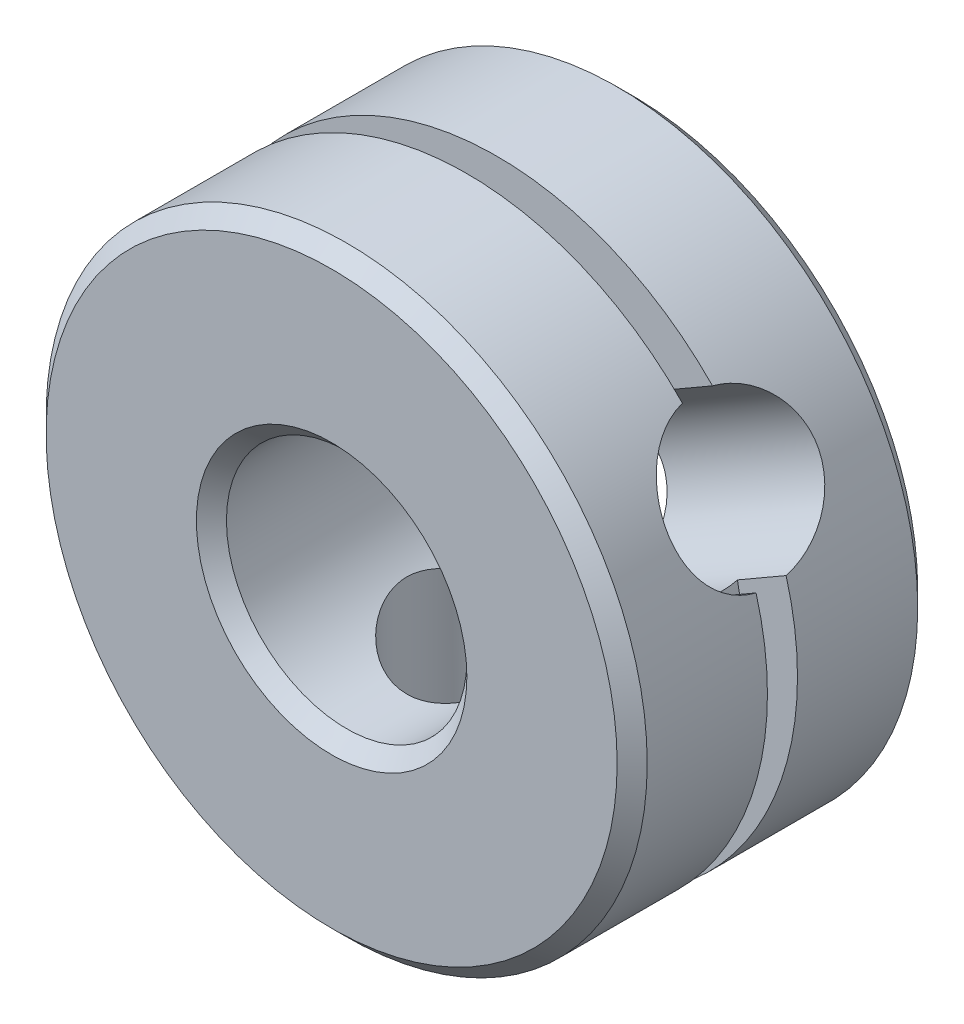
ISO-10303-21;
HEADER;
FILE_DESCRIPTION(('STEP AP214'),'2;1');
FILE_NAME('part.step','',(''),(''),'','','');
FILE_SCHEMA(('AUTOMOTIVE_DESIGN { 1 0 10303 214 1 1 1 1 }'));
ENDSEC;
DATA;
#1=APPLICATION_CONTEXT('core data for automotive mechanical design processes');
#2=APPLICATION_PROTOCOL_DEFINITION('international standard','automotive_design',2000,#1);
#3=PRODUCT_CONTEXT('',#1,'mechanical');
#4=PRODUCT('Part','Part','',(#3));
#5=PRODUCT_RELATED_PRODUCT_CATEGORY('part','',(#4));
#6=PRODUCT_DEFINITION_FORMATION('','',#4);
#7=PRODUCT_DEFINITION_CONTEXT('part definition',#1,'design');
#8=PRODUCT_DEFINITION('design','',#6,#7);
#9=PRODUCT_DEFINITION_SHAPE('','',#8);
#10=(LENGTH_UNIT() NAMED_UNIT(*) SI_UNIT(.MILLI.,.METRE.));
#11=(NAMED_UNIT(*) PLANE_ANGLE_UNIT() SI_UNIT($,.RADIAN.));
#12=(NAMED_UNIT(*) SI_UNIT($,.STERADIAN.) SOLID_ANGLE_UNIT());
#13=UNCERTAINTY_MEASURE_WITH_UNIT(LENGTH_MEASURE(1.E-05),#10,'distance_accuracy_value','');
#14=(GEOMETRIC_REPRESENTATION_CONTEXT(3) GLOBAL_UNCERTAINTY_ASSIGNED_CONTEXT((#13)) GLOBAL_UNIT_ASSIGNED_CONTEXT((#10,
#11,#12)) REPRESENTATION_CONTEXT('',''));
#15=CARTESIAN_POINT('',(0.,0.,0.));
#16=DIRECTION('',(0.,0.,1.));
#17=DIRECTION('',(1.,0.,0.));
#18=AXIS2_PLACEMENT_3D('',#15,#16,#17);
#19=CARTESIAN_POINT('',(0.,0.,-10.));
#20=DIRECTION('',(0.,0.,1.));
#21=DIRECTION('',(1.,0.,0.));
#22=AXIS2_PLACEMENT_3D('',#19,#20,#21);
#23=CYLINDRICAL_SURFACE('',#22,10.);
#24=CARTESIAN_POINT('',(0.,0.,-4.5));
#25=DIRECTION('',(0.,0.,-1.));
#26=DIRECTION('',(-1.,0.,0.));
#27=AXIS2_PLACEMENT_3D('',#24,#25,#26);
#28=CIRCLE('',#27,10.);
#29=CARTESIAN_POINT('',(-2.44948974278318,-9.69535971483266,-4.5));
#30=VERTEX_POINT('',#29);
#31=CARTESIAN_POINT('',(7.17168294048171,6.96900020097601,-4.5));
#32=VERTEX_POINT('',#31);
#33=EDGE_CURVE('E227',#30,#32,#28,.T.);
#34=ORIENTED_EDGE('',*,*,#33,.F.);
#35=CARTESIAN_POINT('',(0.,-10.,-2.5));
#36=CARTESIAN_POINT('',(-0.138126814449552,-9.99999766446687,-2.50000387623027));
#37=CARTESIAN_POINT('',(-0.276296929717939,-9.99710963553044,-2.51148591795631));
#38=CARTESIAN_POINT('',(-0.548677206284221,-9.98586856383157,-2.55704191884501));
#39=CARTESIAN_POINT('',(-0.682885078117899,-9.97751242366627,-2.59112868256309));
#40=CARTESIAN_POINT('',(-0.943368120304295,-9.9562604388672,-2.68073208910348));
#41=CARTESIAN_POINT('',(-1.06965260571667,-9.94337004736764,-2.73622299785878));
#42=CARTESIAN_POINT('',(-1.31112021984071,-9.91442239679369,-2.86696898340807));
#43=CARTESIAN_POINT('',(-1.42630297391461,-9.89836503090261,-2.94222472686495));
#44=CARTESIAN_POINT('',(-1.64466987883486,-9.86445689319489,-3.1120013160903));
#45=CARTESIAN_POINT('',(-1.74759281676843,-9.84657845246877,-3.20685262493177));
#46=CARTESIAN_POINT('',(-1.93624821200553,-9.8112270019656,-3.41242034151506));
#47=CARTESIAN_POINT('',(-2.02197872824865,-9.79375403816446,-3.5231385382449));
#48=CARTESIAN_POINT('',(-2.17504423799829,-9.76091292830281,-3.75932537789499));
#49=CARTESIAN_POINT('',(-2.2420870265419,-9.74557990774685,-3.88498871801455));
#50=CARTESIAN_POINT('',(-2.35399484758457,-9.71915824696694,-4.14624735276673));
#51=CARTESIAN_POINT('',(-2.39886342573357,-9.70806892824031,-4.28184105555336));
#52=CARTESIAN_POINT('',(-2.46425806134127,-9.69167461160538,-4.55623916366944));
#53=CARTESIAN_POINT('',(-2.48525378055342,-9.68625818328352,-4.69492482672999));
#54=CARTESIAN_POINT('',(-2.50376962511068,-9.68148937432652,-4.97394761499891));
#55=CARTESIAN_POINT('',(-2.50129356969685,-9.68213600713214,-5.11428446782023));
#56=CARTESIAN_POINT('',(-2.47331087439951,-9.68932009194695,-5.38902634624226));
#57=CARTESIAN_POINT('',(-2.44836390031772,-9.69571438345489,-5.52349270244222));
#58=CARTESIAN_POINT('',(-2.37704031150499,-9.71344516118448,-5.7862684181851));
#59=CARTESIAN_POINT('',(-2.33066217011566,-9.72478199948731,-5.91457733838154));
#60=CARTESIAN_POINT('',(-2.21731579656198,-9.75125189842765,-6.16289669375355));
#61=CARTESIAN_POINT('',(-2.1501444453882,-9.76642212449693,-6.28281028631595));
#62=CARTESIAN_POINT('',(-1.99726046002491,-9.79882851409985,-6.50986451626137));
#63=CARTESIAN_POINT('',(-1.91154458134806,-9.81606503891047,-6.61700291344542));
#64=CARTESIAN_POINT('',(-1.72110570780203,-9.85126467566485,-6.81867269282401));
#65=CARTESIAN_POINT('',(-1.61591043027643,-9.86923449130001,-6.91275748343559));
#66=CARTESIAN_POINT('',(-1.39101986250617,-9.90343275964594,-7.08203540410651));
#67=CARTESIAN_POINT('',(-1.27132412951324,-9.91966115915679,-7.15722795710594));
#68=CARTESIAN_POINT('',(-1.02019314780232,-9.94862886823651,-7.28675097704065));
#69=CARTESIAN_POINT('',(-0.888718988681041,-9.96135600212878,-7.34100890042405));
#70=CARTESIAN_POINT('',(-0.61812668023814,-9.98179861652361,-7.42652884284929));
#71=CARTESIAN_POINT('',(-0.479009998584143,-9.98951505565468,-7.4577952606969));
#72=CARTESIAN_POINT('',(-0.200899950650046,-9.99892498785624,-7.49576260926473));
#73=CARTESIAN_POINT('',(-0.0619945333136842,-10.0007675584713,-7.50307171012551));
#74=CARTESIAN_POINT('',(0.215054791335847,-9.99864674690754,-7.49458499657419));
#75=CARTESIAN_POINT('',(0.353198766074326,-9.99468388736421,-7.47879126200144));
#76=CARTESIAN_POINT('',(0.622690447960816,-9.98149301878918,-7.42504848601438));
#77=CARTESIAN_POINT('',(0.754108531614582,-9.97234390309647,-7.38743122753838));
#78=CARTESIAN_POINT('',(1.00876215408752,-9.94981177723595,-7.2914881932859));
#79=CARTESIAN_POINT('',(1.13199686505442,-9.93642833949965,-7.23316032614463));
#80=CARTESIAN_POINT('',(1.36920522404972,-9.9065551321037,-7.09627311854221));
#81=CARTESIAN_POINT('',(1.48297573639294,-9.89001445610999,-7.01737314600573));
#82=CARTESIAN_POINT('',(1.69587768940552,-9.85574181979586,-6.84201681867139));
#83=CARTESIAN_POINT('',(1.79500659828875,-9.83800965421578,-6.74555743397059));
#84=CARTESIAN_POINT('',(1.97831761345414,-9.80281594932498,-6.53499673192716));
#85=CARTESIAN_POINT('',(2.06207311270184,-9.78537173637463,-6.42052049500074));
#86=CARTESIAN_POINT('',(2.20918459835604,-9.75321463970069,-6.17877894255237));
#87=CARTESIAN_POINT('',(2.27254149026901,-9.73850163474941,-6.05151419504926));
#88=CARTESIAN_POINT('',(2.37658570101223,-9.71363491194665,-5.78849046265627));
#89=CARTESIAN_POINT('',(2.41740732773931,-9.70345425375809,-5.65278728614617));
#90=CARTESIAN_POINT('',(2.47557609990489,-9.68877906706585,-5.37615060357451));
#91=CARTESIAN_POINT('',(2.49292837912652,-9.68428329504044,-5.23521824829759));
#92=CARTESIAN_POINT('',(2.50339765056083,-9.68158168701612,-4.95646496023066));
#93=CARTESIAN_POINT('',(2.49719649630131,-9.68319887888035,-4.81867094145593));
#94=CARTESIAN_POINT('',(2.46229546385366,-9.69213181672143,-4.54616018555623));
#95=CARTESIAN_POINT('',(2.43359603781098,-9.69944744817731,-4.41144338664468));
#96=CARTESIAN_POINT('',(2.35488553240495,-9.71885434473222,-4.14965256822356));
#97=CARTESIAN_POINT('',(2.30500234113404,-9.73091692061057,-4.02253782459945));
#98=CARTESIAN_POINT('',(2.18544152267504,-9.7584625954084,-3.77839102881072));
#99=CARTESIAN_POINT('',(2.11576115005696,-9.77394616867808,-3.66136037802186));
#100=CARTESIAN_POINT('',(1.95644624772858,-9.80709390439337,-3.43740895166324));
#101=CARTESIAN_POINT('',(1.86633860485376,-9.82480441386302,-3.33083154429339));
#102=CARTESIAN_POINT('',(1.66964895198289,-9.86013378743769,-3.13408825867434));
#103=CARTESIAN_POINT('',(1.56306303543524,-9.87775262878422,-3.04392628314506));
#104=CARTESIAN_POINT('',(1.33411264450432,-9.91129426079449,-2.88098115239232));
#105=CARTESIAN_POINT('',(1.21149737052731,-9.92718055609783,-2.80854231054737));
#106=CARTESIAN_POINT('',(0.955443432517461,-9.95508208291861,-2.68542089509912));
#107=CARTESIAN_POINT('',(0.8220126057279,-9.96710008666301,-2.63472273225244));
#108=CARTESIAN_POINT('',(0.574017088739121,-9.98413432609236,-2.56404694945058));
#109=CARTESIAN_POINT('',(0.460633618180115,-9.99004308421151,-2.54008126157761));
#110=CARTESIAN_POINT('',(0.231510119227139,-9.9979767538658,-2.5080567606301));
#111=CARTESIAN_POINT('',(0.115770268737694,-10.0000019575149,-2.49999675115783));
#112=CARTESIAN_POINT('',(0.,-10.,-2.5));
#113=B_SPLINE_CURVE_WITH_KNOTS('',3,(#35,#36,#37,#38,#39,#40,#41,#42,#43,#44,#45,#46,#47,#48,
#49,#50,#51,#52,#53,#54,#55,#56,#57,#58,#59,#60,#61,#62,#63,#64,#65,#66,#67,#68,#69,#70,#71,#72,
#73,#74,#75,#76,#77,#78,#79,#80,#81,#82,#83,#84,#85,#86,#87,#88,#89,#90,#91,#92,#93,#94,#95,#96,
#97,#98,#99,#100,#101,#102,#103,#104,#105,#106,#107,#108,#109,#110,#111,#112),.UNSPECIFIED.,.T.,
.F.,(4,2,2,2,2,2,2,2,2,2,2,2,2,2,2,2,2,2,2,2,2,2,2,2,2,2,2,2,2,2,2,2,2,2,2,2,2,2,4),(0.,
0.41395618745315,0.828147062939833,1.24184150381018,1.65554990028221,2.07690725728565,
2.4983121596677,2.92597745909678,3.35357435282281,3.77260491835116,4.19156730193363,
4.60037495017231,5.00921172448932,5.42217546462,5.83521151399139,6.26002501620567,
6.6848514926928,7.11113715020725,7.53734122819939,7.95263848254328,8.36789835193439,
8.7770045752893,9.18615212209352,9.60255979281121,10.0190393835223,10.4457418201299,
10.8724253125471,11.2965375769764,11.7205570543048,12.1323963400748,12.5442273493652,
12.9536066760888,13.3630428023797,13.7831596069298,14.2033761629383,14.6312030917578,
15.0587227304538,15.4057040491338,15.752659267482),.UNSPECIFIED.);
#114=CARTESIAN_POINT('',(2.44948974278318,-9.69535971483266,-4.5));
#115=VERTEX_POINT('',#114);
#116=EDGE_CURVE('E124',#115,#30,#113,.T.);
#117=ORIENTED_EDGE('',*,*,#116,.F.);
#118=CARTESIAN_POINT('',(9.62117268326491,2.72635951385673,-4.5));
#119=VERTEX_POINT('',#118);
#120=EDGE_CURVE('E392',#119,#115,#28,.T.);
#121=ORIENTED_EDGE('',*,*,#120,.F.);
#122=CARTESIAN_POINT('',(9.6352549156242,2.67616567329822,-5.));
#123=CARTESIAN_POINT('',(9.63525523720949,2.67617038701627,-5.13805075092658));
#124=CARTESIAN_POINT('',(9.63210285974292,2.68759458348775,-5.27614489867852));
#125=CARTESIAN_POINT('',(9.61937602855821,2.73278922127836,-5.54836757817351));
#126=CARTESIAN_POINT('',(9.60979783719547,2.76657266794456,-5.68249375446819));
#127=CARTESIAN_POINT('',(9.58391006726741,2.85495532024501,-5.94280353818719));
#128=CARTESIAN_POINT('',(9.56760917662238,2.90952765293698,-6.06899715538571));
#129=CARTESIAN_POINT('',(9.5278131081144,3.03730745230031,-6.31031085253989));
#130=CARTESIAN_POINT('',(9.5043176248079,3.11051571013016,-6.42543046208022));
#131=CARTESIAN_POINT('',(9.44907629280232,3.27453410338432,-6.64386164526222));
#132=CARTESIAN_POINT('',(9.4171759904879,3.36566467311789,-6.74689360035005));
#133=CARTESIAN_POINT('',(9.34490436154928,3.56140836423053,-6.93576139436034));
#134=CARTESIAN_POINT('',(9.30453224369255,3.66602274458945,-7.02159562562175));
#135=CARTESIAN_POINT('',(9.21449269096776,3.88683880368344,-7.17477546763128));
#136=CARTESIAN_POINT('',(9.16470341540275,4.00318179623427,-7.24184638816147));
#137=CARTESIAN_POINT('',(9.05647555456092,4.24234044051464,-7.35380964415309));
#138=CARTESIAN_POINT('',(8.9980382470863,4.36515513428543,-7.39870525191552));
#139=CARTESIAN_POINT('',(8.87468040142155,4.61069782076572,-7.46414783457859));
#140=CARTESIAN_POINT('',(8.80991518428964,4.73337716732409,-7.48516964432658));
#141=CARTESIAN_POINT('',(8.67447899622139,4.97723353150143,-7.50375837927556));
#142=CARTESIAN_POINT('',(8.60380889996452,5.09841076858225,-7.5013287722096));
#143=CARTESIAN_POINT('',(8.46033146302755,5.33303795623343,-7.47342514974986));
#144=CARTESIAN_POINT('',(8.38760634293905,5.44659970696,-7.44846367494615));
#145=CARTESIAN_POINT('',(8.24102110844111,5.66594946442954,-7.3770287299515));
#146=CARTESIAN_POINT('',(8.16716093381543,5.77173705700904,-7.33055411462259));
#147=CARTESIAN_POINT('',(8.02036378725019,5.9740726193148,-7.21699742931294));
#148=CARTESIAN_POINT('',(7.94744118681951,6.07052846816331,-7.14973295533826));
#149=CARTESIAN_POINT('',(7.80609517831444,6.25124461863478,-6.99664432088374));
#150=CARTESIAN_POINT('',(7.73767255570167,6.33550279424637,-6.91081693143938));
#151=CARTESIAN_POINT('',(7.60646202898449,6.49249557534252,-6.72029125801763));
#152=CARTESIAN_POINT('',(7.54387674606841,6.56485658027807,-6.61514510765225));
#153=CARTESIAN_POINT('',(7.42950428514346,6.69402197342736,-6.39040002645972));
#154=CARTESIAN_POINT('',(7.37771761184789,6.75082563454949,-6.27080042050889));
#155=CARTESIAN_POINT('',(7.28744965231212,6.84817688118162,-6.01970996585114));
#156=CARTESIAN_POINT('',(7.24903410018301,6.88864430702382,-5.8881642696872));
#157=CARTESIAN_POINT('',(7.1881168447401,6.95218921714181,-5.61741453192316));
#158=CARTESIAN_POINT('',(7.16561173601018,6.97527042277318,-5.4782121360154));
#159=CARTESIAN_POINT('',(7.13828856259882,7.00322865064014,-5.20004049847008));
#160=CARTESIAN_POINT('',(7.1330190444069,7.00857038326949,-5.06116220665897));
#161=CARTESIAN_POINT('',(7.13922190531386,7.00225180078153,-4.78417806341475));
#162=CARTESIAN_POINT('',(7.15069274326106,6.99059305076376,-4.64607214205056));
#163=CARTESIAN_POINT('',(7.18934405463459,6.95083246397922,-4.37688573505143));
#164=CARTESIAN_POINT('',(7.21626442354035,6.92300278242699,-4.2457272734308));
#165=CARTESIAN_POINT('',(7.28408845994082,6.85160306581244,-3.99156854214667));
#166=CARTESIAN_POINT('',(7.32499378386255,6.80803116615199,-3.86856924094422));
#167=CARTESIAN_POINT('',(7.41957761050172,6.70483734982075,-3.6315587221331));
#168=CARTESIAN_POINT('',(7.47349094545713,6.64491734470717,-3.51777115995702));
#169=CARTESIAN_POINT('',(7.59098627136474,6.51036775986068,-3.30481163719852));
#170=CARTESIAN_POINT('',(7.65456985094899,6.43573576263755,-3.20564208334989));
#171=CARTESIAN_POINT('',(7.79021214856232,6.27090481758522,-3.02218895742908));
#172=CARTESIAN_POINT('',(7.86244311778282,6.1803630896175,-2.9383399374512));
#173=CARTESIAN_POINT('',(8.01084582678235,5.98675234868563,-2.79106413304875));
#174=CARTESIAN_POINT('',(8.0870173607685,5.88368398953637,-2.72763628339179));
#175=CARTESIAN_POINT('',(8.23956671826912,5.66805412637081,-2.62355396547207));
#176=CARTESIAN_POINT('',(8.31593892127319,5.55556787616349,-2.58273571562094));
#177=CARTESIAN_POINT('',(8.46649332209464,5.32330927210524,-2.52453966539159));
#178=CARTESIAN_POINT('',(8.54067593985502,5.20353832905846,-2.50715734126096));
#179=CARTESIAN_POINT('',(8.68234823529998,4.96344019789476,-2.49658102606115));
#180=CARTESIAN_POINT('',(8.74996464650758,4.84321561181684,-2.50274572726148));
#181=CARTESIAN_POINT('',(8.87886382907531,4.60265155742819,-2.53761956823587));
#182=CARTESIAN_POINT('',(8.94014678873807,4.48231209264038,-2.56632803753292));
#183=CARTESIAN_POINT('',(9.05484155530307,4.24582601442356,-2.64513054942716));
#184=CARTESIAN_POINT('',(9.10829395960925,4.12966031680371,-2.69510863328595));
#185=CARTESIAN_POINT('',(9.20712587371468,3.90435464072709,-2.81492644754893));
#186=CARTESIAN_POINT('',(9.25250436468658,3.79521555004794,-2.88476868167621));
#187=CARTESIAN_POINT('',(9.33607529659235,3.58480572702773,-3.04428808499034));
#188=CARTESIAN_POINT('',(9.37406953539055,3.48378613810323,-3.13440035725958));
#189=CARTESIAN_POINT('',(9.4417659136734,3.29591417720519,-3.33105712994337));
#190=CARTESIAN_POINT('',(9.47146594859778,3.20906540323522,-3.43760579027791));
#191=CARTESIAN_POINT('',(9.52353066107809,3.05113481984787,-3.66650353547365));
#192=CARTESIAN_POINT('',(9.54574815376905,2.98037738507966,-3.78911030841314));
#193=CARTESIAN_POINT('',(9.58262240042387,2.85960890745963,-4.04513872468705));
#194=CARTESIAN_POINT('',(9.59728465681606,2.80958277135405,-4.17855241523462));
#195=CARTESIAN_POINT('',(9.61743337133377,2.73971219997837,-4.4264425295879));
#196=CARTESIAN_POINT('',(9.62413024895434,2.71595058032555,-4.53973291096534));
#197=CARTESIAN_POINT('',(9.63304069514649,2.68417601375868,-4.76867217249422));
#198=CARTESIAN_POINT('',(9.63525464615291,2.67616172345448,-4.88432085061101));
#199=CARTESIAN_POINT('',(9.6352549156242,2.67616567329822,-5.));
#200=B_SPLINE_CURVE_WITH_KNOTS('',3,(#122,#123,#124,#125,#126,#127,#128,#129,#130,#131,#132,
#133,#134,#135,#136,#137,#138,#139,#140,#141,#142,#143,#144,#145,#146,#147,#148,#149,#150,#151,
#152,#153,#154,#155,#156,#157,#158,#159,#160,#161,#162,#163,#164,#165,#166,#167,#168,#169,#170,
#171,#172,#173,#174,#175,#176,#177,#178,#179,#180,#181,#182,#183,#184,#185,#186,#187,#188,#189,
#190,#191,#192,#193,#194,#195,#196,#197,#198,#199),.UNSPECIFIED.,.T.,.F.,(4,2,2,2,2,2,2,2,2,2,2,
2,2,2,2,2,2,2,2,2,2,2,2,2,2,2,2,2,2,2,2,2,2,2,2,2,2,2,4),(0.,0.413727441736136,
0.827695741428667,1.24113072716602,1.65458326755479,2.07623954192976,2.49793521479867,
2.9255149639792,3.35303159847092,3.77188750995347,4.19068148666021,4.60018262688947,
5.00970556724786,5.42292874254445,5.83622385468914,6.26070466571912,6.68520531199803,
7.11176432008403,7.53823200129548,7.95343574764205,8.36860127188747,8.77697405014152,
9.18539521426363,9.60182845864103,10.0183301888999,10.4452533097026,10.872154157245,
11.2959207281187,11.7196054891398,12.131834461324,12.5440511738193,12.9540487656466,
13.3640980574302,13.7839709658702,14.2039503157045,14.6317647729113,15.0592672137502,
15.4059782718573,15.7526597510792),.UNSPECIFIED.);
#201=EDGE_CURVE('E121',#32,#119,#200,.T.);
#202=ORIENTED_EDGE('',*,*,#201,.F.);
#203=EDGE_LOOP('',(#34,#117,#121,#202));
#204=FACE_BOUND('',#203,.T.);
#205=CARTESIAN_POINT('',(0.,0.,-0.500000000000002));
#206=DIRECTION('',(0.,0.,1.));
#207=DIRECTION('',(1.,0.,0.));
#208=AXIS2_PLACEMENT_3D('',#205,#206,#207);
#209=CIRCLE('',#208,10.);
#210=CARTESIAN_POINT('',(10.,0.,-0.500000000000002));
#211=VERTEX_POINT('',#210);
#212=EDGE_CURVE('E230',#211,#211,#209,.F.);
#213=ORIENTED_EDGE('',*,*,#212,.T.);
#214=EDGE_LOOP('',(#213));
#215=FACE_BOUND('',#214,.T.);
#216=ADVANCED_FACE('F32',(#204,#215),#23,.T.);
#217=CARTESIAN_POINT('',(0.,0.,-5.5));
#218=DIRECTION('',(0.,0.,-1.));
#219=DIRECTION('',(-1.,0.,0.));
#220=AXIS2_PLACEMENT_3D('',#217,#218,#219);
#221=CIRCLE('',#220,10.);
#222=CARTESIAN_POINT('',(9.62117268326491,2.72635951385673,-5.5));
#223=VERTEX_POINT('',#222);
#224=CARTESIAN_POINT('',(2.44948974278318,-9.69535971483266,-5.5));
#225=VERTEX_POINT('',#224);
#226=EDGE_CURVE('E55',#223,#225,#221,.T.);
#227=ORIENTED_EDGE('',*,*,#226,.T.);
#228=CARTESIAN_POINT('',(-2.44948974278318,-9.69535971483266,-5.5));
#229=VERTEX_POINT('',#228);
#230=EDGE_CURVE('E113',#229,#225,#113,.T.);
#231=ORIENTED_EDGE('',*,*,#230,.F.);
#232=CARTESIAN_POINT('',(7.17168294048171,6.96900020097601,-5.5));
#233=VERTEX_POINT('',#232);
#234=EDGE_CURVE('E98',#229,#233,#221,.T.);
#235=ORIENTED_EDGE('',*,*,#234,.T.);
#236=EDGE_CURVE('E111',#223,#233,#200,.T.);
#237=ORIENTED_EDGE('',*,*,#236,.F.);
#238=EDGE_LOOP('',(#227,#231,#235,#237));
#239=FACE_BOUND('',#238,.T.);
#240=CARTESIAN_POINT('',(0.,0.,-9.5));
#241=DIRECTION('',(0.,0.,1.));
#242=DIRECTION('',(1.,0.,0.));
#243=AXIS2_PLACEMENT_3D('',#240,#241,#242);
#244=CIRCLE('',#243,10.);
#245=CARTESIAN_POINT('',(10.,0.,-9.5));
#246=VERTEX_POINT('',#245);
#247=EDGE_CURVE('E231',#246,#246,#244,.T.);
#248=ORIENTED_EDGE('',*,*,#247,.T.);
#249=EDGE_LOOP('',(#248));
#250=FACE_BOUND('',#249,.T.);
#251=ADVANCED_FACE('F109',(#239,#250),#23,.T.);
#252=CARTESIAN_POINT('',(0.,0.,-10.));
#253=DIRECTION('',(0.,0.,1.));
#254=DIRECTION('',(1.,0.,0.));
#255=AXIS2_PLACEMENT_3D('',#252,#253,#254);
#256=PLANE('',#255);
#257=CARTESIAN_POINT('',(0.,0.,-10.));
#258=DIRECTION('',(0.,0.,1.));
#259=DIRECTION('',(1.,0.,0.));
#260=AXIS2_PLACEMENT_3D('',#257,#258,#259);
#261=CIRCLE('',#260,4.5);
#262=CARTESIAN_POINT('',(4.5,0.,-10.));
#263=VERTEX_POINT('',#262);
#264=EDGE_CURVE('E240',#263,#263,#261,.T.);
#265=ORIENTED_EDGE('',*,*,#264,.T.);
#266=EDGE_LOOP('',(#265));
#267=FACE_BOUND('',#266,.T.);
#268=CARTESIAN_POINT('',(0.,0.,-10.));
#269=DIRECTION('',(0.,0.,1.));
#270=DIRECTION('',(1.,0.,0.));
#271=AXIS2_PLACEMENT_3D('',#268,#269,#270);
#272=CIRCLE('',#271,9.5);
#273=CARTESIAN_POINT('',(9.5,0.,-10.));
#274=VERTEX_POINT('',#273);
#275=EDGE_CURVE('E233',#274,#274,#272,.F.);
#276=ORIENTED_EDGE('',*,*,#275,.T.);
#277=EDGE_LOOP('',(#276));
#278=FACE_BOUND('',#277,.T.);
#279=ADVANCED_FACE('F223',(#267,#278),#256,.F.);
#280=CARTESIAN_POINT('',(0.,0.,0.));
#281=DIRECTION('',(0.,0.,1.));
#282=DIRECTION('',(1.,0.,0.));
#283=AXIS2_PLACEMENT_3D('',#280,#281,#282);
#284=PLANE('',#283);
#285=CARTESIAN_POINT('',(0.,0.,0.));
#286=DIRECTION('',(0.,0.,1.));
#287=DIRECTION('',(1.,0.,0.));
#288=AXIS2_PLACEMENT_3D('',#285,#286,#287);
#289=CIRCLE('',#288,4.5);
#290=CARTESIAN_POINT('',(4.5,0.,0.));
#291=VERTEX_POINT('',#290);
#292=EDGE_CURVE('E104',#291,#291,#289,.F.);
#293=ORIENTED_EDGE('',*,*,#292,.T.);
#294=EDGE_LOOP('',(#293));
#295=FACE_BOUND('',#294,.T.);
#296=CARTESIAN_POINT('',(0.,0.,0.));
#297=DIRECTION('',(0.,0.,1.));
#298=DIRECTION('',(1.,0.,0.));
#299=AXIS2_PLACEMENT_3D('',#296,#297,#298);
#300=CIRCLE('',#299,9.5);
#301=CARTESIAN_POINT('',(9.5,0.,0.));
#302=VERTEX_POINT('',#301);
#303=EDGE_CURVE('E238',#302,#302,#300,.T.);
#304=ORIENTED_EDGE('',*,*,#303,.T.);
#305=EDGE_LOOP('',(#304));
#306=FACE_BOUND('',#305,.T.);
#307=ADVANCED_FACE('F207',(#295,#306),#284,.T.);
#308=CARTESIAN_POINT('',(0.,0.,-10.));
#309=DIRECTION('',(0.,0.,1.));
#310=DIRECTION('',(1.,0.,0.));
#311=AXIS2_PLACEMENT_3D('',#308,#309,#310);
#312=CYLINDRICAL_SURFACE('',#311,4.);
#313=CARTESIAN_POINT('',(0.,0.,-9.49999999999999));
#314=DIRECTION('',(0.,0.,1.));
#315=DIRECTION('',(1.,0.,0.));
#316=AXIS2_PLACEMENT_3D('',#313,#314,#315);
#317=CIRCLE('',#316,4.);
#318=CARTESIAN_POINT('',(4.,0.,-9.49999999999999));
#319=VERTEX_POINT('',#318);
#320=EDGE_CURVE('E258',#319,#319,#317,.F.);
#321=ORIENTED_EDGE('',*,*,#320,.T.);
#322=EDGE_LOOP('',(#321));
#323=FACE_BOUND('',#322,.T.);
#324=CARTESIAN_POINT('',(0.,0.,-0.5));
#325=DIRECTION('',(0.,0.,1.));
#326=DIRECTION('',(1.,0.,0.));
#327=AXIS2_PLACEMENT_3D('',#324,#325,#326);
#328=CIRCLE('',#327,4.);
#329=CARTESIAN_POINT('',(4.,0.,-0.5));
#330=VERTEX_POINT('',#329);
#331=EDGE_CURVE('E260',#330,#330,#328,.T.);
#332=ORIENTED_EDGE('',*,*,#331,.T.);
#333=EDGE_LOOP('',(#332));
#334=FACE_BOUND('',#333,.T.);
#335=CARTESIAN_POINT('',(4.,0.,-6.49999999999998));
#336=CARTESIAN_POINT('',(3.9999969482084,0.0987788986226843,-6.61406170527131));
#337=CARTESIAN_POINT('',(3.99632017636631,0.206437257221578,-6.72052845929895));
#338=CARTESIAN_POINT('',(3.97786278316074,0.435751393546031,-6.91659296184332));
#339=CARTESIAN_POINT('',(3.96305623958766,0.557439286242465,-7.00615071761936));
#340=CARTESIAN_POINT('',(3.91895755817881,0.811450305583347,-7.16603627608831));
#341=CARTESIAN_POINT('',(3.88959514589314,0.943822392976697,-7.23626819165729));
#342=CARTESIAN_POINT('',(3.81395521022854,1.21379485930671,-7.35359275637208));
#343=CARTESIAN_POINT('',(3.76770815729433,1.35138542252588,-7.40072673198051));
#344=CARTESIAN_POINT('',(3.66352948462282,1.61120760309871,-7.46526784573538));
#345=CARTESIAN_POINT('',(3.60739408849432,1.7334965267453,-7.4853310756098));
#346=CARTESIAN_POINT('',(3.4821851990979,1.97296614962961,-7.50344059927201));
#347=CARTESIAN_POINT('',(3.41311860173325,2.09014953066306,-7.50149859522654));
#348=CARTESIAN_POINT('',(3.27291668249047,2.30270164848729,-7.47719736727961));
#349=CARTESIAN_POINT('',(3.20285057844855,2.39905069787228,-7.45711471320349));
#350=CARTESIAN_POINT('',(3.05709279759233,2.5822251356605,-7.4006920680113));
#351=CARTESIAN_POINT('',(2.98140044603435,2.6690493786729,-7.36435012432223));
#352=CARTESIAN_POINT('',(2.82438197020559,2.83484989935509,-7.27536092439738));
#353=CARTESIAN_POINT('',(2.74295123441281,2.91343794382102,-7.22218042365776));
#354=CARTESIAN_POINT('',(2.57992924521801,3.0587428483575,-7.10179772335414));
#355=CARTESIAN_POINT('',(2.49833794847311,3.12545586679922,-7.03459100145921));
#356=CARTESIAN_POINT('',(2.3266997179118,3.25570405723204,-6.87756512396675));
#357=CARTESIAN_POINT('',(2.23703857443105,3.3175319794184,-6.78590567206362));
#358=CARTESIAN_POINT('',(2.06516568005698,3.42717250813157,-6.58811617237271));
#359=CARTESIAN_POINT('',(1.9829664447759,3.47496185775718,-6.48196253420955));
#360=CARTESIAN_POINT('',(1.82253960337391,3.56195555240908,-6.24427953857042));
#361=CARTESIAN_POINT('',(1.7456826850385,3.59969012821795,-6.11124976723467));
#362=CARTESIAN_POINT('',(1.64753666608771,3.6451246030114,-5.90158132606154));
#363=CARTESIAN_POINT('',(1.6176913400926,3.65840332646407,-5.83005292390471));
#364=CARTESIAN_POINT('',(1.56469353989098,3.68138049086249,-5.68402200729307));
#365=CARTESIAN_POINT('',(1.54153757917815,3.6910807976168,-5.6095210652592));
#366=CARTESIAN_POINT('',(1.49465901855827,3.71037902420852,-5.42576700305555));
#367=CARTESIAN_POINT('',(1.47491733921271,3.71816419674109,-5.31525969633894));
#368=CARTESIAN_POINT('',(1.4532360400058,3.72669428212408,-5.0923238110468));
#369=CARTESIAN_POINT('',(1.45128029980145,3.72744557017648,-4.97989706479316));
#370=CARTESIAN_POINT('',(1.46534347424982,3.72193734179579,-4.75643263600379));
#371=CARTESIAN_POINT('',(1.48135272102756,3.71568159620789,-4.64539423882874));
#372=CARTESIAN_POINT('',(1.52959153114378,3.69608031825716,-4.42753310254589));
#373=CARTESIAN_POINT('',(1.56183611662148,3.68272821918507,-4.3207143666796));
#374=CARTESIAN_POINT('',(1.64133328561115,3.64800897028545,-4.10899144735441));
#375=CARTESIAN_POINT('',(1.68916217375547,3.62632714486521,-4.00435863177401));
#376=CARTESIAN_POINT('',(1.79594275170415,3.57464804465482,-3.80318038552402));
#377=CARTESIAN_POINT('',(1.85489927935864,3.54464715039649,-3.70663849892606));
#378=CARTESIAN_POINT('',(1.99432678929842,3.46846086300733,-3.50283460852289));
#379=CARTESIAN_POINT('',(2.07670790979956,3.42019154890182,-3.39764914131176));
#380=CARTESIAN_POINT('',(2.24885090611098,3.30955889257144,-3.2015907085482));
#381=CARTESIAN_POINT('',(2.3386201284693,3.24718141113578,-3.11073225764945));
#382=CARTESIAN_POINT('',(2.53145361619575,3.09966993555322,-2.93611309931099));
#383=CARTESIAN_POINT('',(2.63490308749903,3.01280040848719,-2.85419435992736));
#384=CARTESIAN_POINT('',(2.78864824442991,2.86852202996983,-2.74879495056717));
#385=CARTESIAN_POINT('',(2.83967005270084,2.81808698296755,-2.71656951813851));
#386=CARTESIAN_POINT('',(2.94053489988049,2.71266619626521,-2.65836260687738));
#387=CARTESIAN_POINT('',(2.99037873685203,2.65768365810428,-2.63237678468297));
#388=CARTESIAN_POINT('',(3.08299753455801,2.54944243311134,-2.5894561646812));
#389=CARTESIAN_POINT('',(3.12596465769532,2.49661048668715,-2.57185693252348));
#390=CARTESIAN_POINT('',(3.20980961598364,2.387851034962,-2.54226829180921));
#391=CARTESIAN_POINT('',(3.2506886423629,2.33192533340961,-2.53027565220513));
#392=CARTESIAN_POINT('',(3.32985934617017,2.21740298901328,-2.51209669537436));
#393=CARTESIAN_POINT('',(3.36815247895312,2.1588078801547,-2.50590708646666));
#394=CARTESIAN_POINT('',(3.44172777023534,2.03946926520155,-2.49942606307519));
#395=CARTESIAN_POINT('',(3.47701025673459,1.97872599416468,-2.49913400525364));
#396=CARTESIAN_POINT('',(3.56891485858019,1.81040797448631,-2.50643854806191));
#397=CARTESIAN_POINT('',(3.62219098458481,1.70118559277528,-2.51998294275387));
#398=CARTESIAN_POINT('',(3.71749803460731,1.48141791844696,-2.56419748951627));
#399=CARTESIAN_POINT('',(3.75952803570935,1.37087251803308,-2.59486904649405));
#400=CARTESIAN_POINT('',(3.83262262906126,1.15088260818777,-2.67217159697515));
#401=CARTESIAN_POINT('',(3.86361080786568,1.04145067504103,-2.71890956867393));
#402=CARTESIAN_POINT('',(3.91507272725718,0.827260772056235,-2.8265866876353));
#403=CARTESIAN_POINT('',(3.9355439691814,0.722503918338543,-2.88752920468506));
#404=CARTESIAN_POINT('',(3.96939942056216,0.507144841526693,-3.03053620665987));
#405=CARTESIAN_POINT('',(3.98156034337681,0.397478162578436,-3.11429702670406));
#406=CARTESIAN_POINT('',(3.99685563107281,0.189785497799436,-3.29609778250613));
#407=CARTESIAN_POINT('',(3.99997647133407,0.091777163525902,-3.3941588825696));
#408=CARTESIAN_POINT('',(4.00002619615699,-0.101106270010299,-3.61659796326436));
#409=CARTESIAN_POINT('',(3.99610961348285,-0.193967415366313,-3.74273817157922));
#410=CARTESIAN_POINT('',(3.98500719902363,-0.35537245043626,-4.00956110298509));
#411=CARTESIAN_POINT('',(3.9778278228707,-0.423963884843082,-4.15021468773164));
#412=CARTESIAN_POINT('',(3.96674693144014,-0.5162111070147,-4.40374091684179));
#413=CARTESIAN_POINT('',(3.96248199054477,-0.546974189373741,-4.51400805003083));
#414=CARTESIAN_POINT('',(3.95636375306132,-0.58963569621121,-4.73814327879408));
#415=CARTESIAN_POINT('',(3.95450709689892,-0.60156040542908,-4.8520061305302));
#416=CARTESIAN_POINT('',(3.95390842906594,-0.605487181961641,-5.08029257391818));
#417=CARTESIAN_POINT('',(3.95517205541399,-0.597453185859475,-5.19471680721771));
#418=CARTESIAN_POINT('',(3.96033984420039,-0.562146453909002,-5.42056279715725));
#419=CARTESIAN_POINT('',(3.96424709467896,-0.534851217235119,-5.53198088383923));
#420=CARTESIAN_POINT('',(3.97320770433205,-0.463553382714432,-5.7480675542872));
#421=CARTESIAN_POINT('',(3.97825050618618,-0.41970231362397,-5.85278756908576));
#422=CARTESIAN_POINT('',(3.98767396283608,-0.31789337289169,-6.05496768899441));
#423=CARTESIAN_POINT('',(3.99205519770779,-0.259947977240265,-6.15243411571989));
#424=CARTESIAN_POINT('',(3.99815363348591,-0.135746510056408,-6.33425981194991));
#425=CARTESIAN_POINT('',(4.00000216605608,-0.0701098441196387,-6.41904294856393));
#426=CARTESIAN_POINT('',(4.,0.,-6.49999999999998));
#427=B_SPLINE_CURVE_WITH_KNOTS('',3,(#335,#336,#337,#338,#339,#340,#341,#342,#343,#344,#345,
#346,#347,#348,#349,#350,#351,#352,#353,#354,#355,#356,#357,#358,#359,#360,#361,#362,#363,#364,
#365,#366,#367,#368,#369,#370,#371,#372,#373,#374,#375,#376,#377,#378,#379,#380,#381,#382,#383,
#384,#385,#386,#387,#388,#389,#390,#391,#392,#393,#394,#395,#396,#397,#398,#399,#400,#401,#402,
#403,#404,#405,#406,#407,#408,#409,#410,#411,#412,#413,#414,#415,#416,#417,#418,#419,#420,#421,
#422,#423,#424,#425,#426),.UNSPECIFIED.,.T.,.F.,(4,2,2,2,2,2,2,2,2,2,2,2,2,2,2,2,2,2,2,2,2,2,2,
2,2,2,2,2,2,2,2,2,2,2,2,2,2,2,2,2,2,2,2,2,2,4),(0.,0.452316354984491,0.905689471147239,
1.36127306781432,1.81603853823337,2.22179714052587,2.62733997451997,2.98813346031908,
3.34897028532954,3.72262222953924,4.09639483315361,4.52171730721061,4.94774046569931,
5.41943939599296,5.65499144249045,5.89042049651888,6.22638844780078,6.56205186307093,
6.8975347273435,7.23332857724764,7.58330357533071,7.93343108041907,8.35790395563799,
8.78280413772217,9.2538417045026,9.48946915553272,9.72493210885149,9.93563403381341,
10.1462143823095,10.3566752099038,10.567113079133,10.9320166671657,11.2969501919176,
11.6643622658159,12.0318615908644,12.4458253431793,12.8604080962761,13.3281621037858,
13.7949946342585,14.137222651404,14.4789727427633,14.8213407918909,15.1641094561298,
15.5038140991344,15.8432191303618,16.1642576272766),.UNSPECIFIED.);
#428=CARTESIAN_POINT('',(4.,0.,-6.49999999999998));
#429=VERTEX_POINT('',#428);
#430=EDGE_CURVE('E126',#429,#429,#427,.T.);
#431=ORIENTED_EDGE('',*,*,#430,.T.);
#432=EDGE_LOOP('',(#431));
#433=FACE_BOUND('',#432,.T.);
#434=CARTESIAN_POINT('',(0.,-4.,-2.5));
#435=CARTESIAN_POINT('',(-0.127017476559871,-3.99999041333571,-2.50001047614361));
#436=CARTESIAN_POINT('',(-0.254191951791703,-3.9938860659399,-2.50974649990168));
#437=CARTESIAN_POINT('',(-0.504637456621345,-3.97004375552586,-2.54817112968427));
#438=CARTESIAN_POINT('',(-0.627900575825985,-3.95228361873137,-2.57689586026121));
#439=CARTESIAN_POINT('',(-0.866410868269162,-3.90691695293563,-2.65162285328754));
#440=CARTESIAN_POINT('',(-0.98169442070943,-3.87935918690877,-2.69753960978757));
#441=CARTESIAN_POINT('',(-1.20252080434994,-3.81669199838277,-2.80477166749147));
#442=CARTESIAN_POINT('',(-1.30806471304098,-3.7815834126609,-2.86608526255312));
#443=CARTESIAN_POINT('',(-1.51594836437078,-3.70340304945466,-3.0077731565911));
#444=CARTESIAN_POINT('',(-1.61735911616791,-3.65991924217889,-3.08927860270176));
#445=CARTESIAN_POINT('',(-1.80597275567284,-3.57062700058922,-3.26643834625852));
#446=CARTESIAN_POINT('',(-1.89315621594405,-3.52481549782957,-3.36211165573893));
#447=CARTESIAN_POINT('',(-2.06285746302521,-3.42860837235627,-3.58006778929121));
#448=CARTESIAN_POINT('',(-2.14314412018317,-3.37843221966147,-3.70419957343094));
#449=CARTESIAN_POINT('',(-2.28147932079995,-3.28660396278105,-3.96712963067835));
#450=CARTESIAN_POINT('',(-2.33956541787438,-3.2449375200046,-4.10590262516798));
#451=CARTESIAN_POINT('',(-2.41866801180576,-3.18619151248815,-4.35762104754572));
#452=CARTESIAN_POINT('',(-2.44539104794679,-3.16553811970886,-4.46793363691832));
#453=CARTESIAN_POINT('',(-2.4836368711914,-3.1356271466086,-4.69261185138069));
#454=CARTESIAN_POINT('',(-2.49518112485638,-3.12635347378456,-4.80697151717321));
#455=CARTESIAN_POINT('',(-2.50237836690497,-3.12059771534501,-5.03682603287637));
#456=CARTESIAN_POINT('',(-2.49798968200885,-3.12414917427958,-5.15232307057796));
#457=CARTESIAN_POINT('',(-2.47352633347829,-3.14354804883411,-5.38062020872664));
#458=CARTESIAN_POINT('',(-2.45343909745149,-3.15940531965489,-5.49341807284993));
#459=CARTESIAN_POINT('',(-2.3993620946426,-3.20065145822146,-5.7108768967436));
#460=CARTESIAN_POINT('',(-2.36570043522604,-3.22581428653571,-5.81566487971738));
#461=CARTESIAN_POINT('',(-2.28580369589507,-3.28291134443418,-6.01832239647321));
#462=CARTESIAN_POINT('',(-2.2395641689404,-3.31484796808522,-6.11618946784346));
#463=CARTESIAN_POINT('',(-2.12589830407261,-3.38909625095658,-6.32166640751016));
#464=CARTESIAN_POINT('',(-2.05612773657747,-3.4322315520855,-6.42768105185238));
#465=CARTESIAN_POINT('',(-1.90176111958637,-3.52011451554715,-6.6276611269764));
#466=CARTESIAN_POINT('',(-1.81714983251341,-3.56486379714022,-6.72161400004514));
#467=CARTESIAN_POINT('',(-1.61904732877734,-3.65959667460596,-6.91060100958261));
#468=CARTESIAN_POINT('',(-1.50309447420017,-3.70922571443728,-7.0032559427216));
#469=CARTESIAN_POINT('',(-1.25426444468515,-3.8005660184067,-7.16771179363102));
#470=CARTESIAN_POINT('',(-1.12139395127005,-3.84228039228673,-7.23952090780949));
#471=CARTESIAN_POINT('',(-0.915775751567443,-3.89435975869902,-7.32734595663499));
#472=CARTESIAN_POINT('',(-0.848193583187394,-3.90966874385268,-7.3528342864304));
#473=CARTESIAN_POINT('',(-0.710492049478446,-3.93701839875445,-7.39800765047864));
#474=CARTESIAN_POINT('',(-0.6403741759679,-3.94906095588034,-7.41769603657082));
#475=CARTESIAN_POINT('',(-0.498239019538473,-3.96949699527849,-7.45093416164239));
#476=CARTESIAN_POINT('',(-0.426223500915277,-3.97789374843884,-7.464489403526));
#477=CARTESIAN_POINT('',(-0.280965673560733,-3.99078766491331,-7.48524629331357));
#478=CARTESIAN_POINT('',(-0.207723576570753,-3.99528549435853,-7.49244902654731));
#479=CARTESIAN_POINT('',(-0.00911917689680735,-4.00193773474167,-7.50310930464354));
#480=CARTESIAN_POINT('',(0.116782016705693,-4.000238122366,-7.50040036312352));
#481=CARTESIAN_POINT('',(0.365967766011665,-3.98518313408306,-7.47624033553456));
#482=CARTESIAN_POINT('',(0.489252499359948,-3.97182855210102,-7.45479052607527));
#483=CARTESIAN_POINT('',(0.7250361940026,-3.93547975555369,-7.39552141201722));
#484=CARTESIAN_POINT('',(0.837768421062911,-3.91288306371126,-7.35837527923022));
#485=CARTESIAN_POINT('',(1.05527816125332,-3.85991402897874,-7.26940762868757));
#486=CARTESIAN_POINT('',(1.16005433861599,-3.82954038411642,-7.21758365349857));
#487=CARTESIAN_POINT('',(1.37016761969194,-3.75980014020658,-7.09496946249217));
#488=CARTESIAN_POINT('',(1.47449380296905,-3.71983526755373,-7.02279282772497));
#489=CARTESIAN_POINT('',(1.67028541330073,-3.63613942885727,-6.86441230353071));
#490=CARTESIAN_POINT('',(1.76173634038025,-3.59240430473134,-6.77819283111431));
#491=CARTESIAN_POINT('',(1.94294835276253,-3.49811738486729,-6.57972991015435));
#492=CARTESIAN_POINT('',(2.03053702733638,-3.44749766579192,-6.46552558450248));
#493=CARTESIAN_POINT('',(2.18560704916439,-3.35133525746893,-6.22224843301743));
#494=CARTESIAN_POINT('',(2.25310231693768,-3.30578906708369,-6.09318598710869));
#495=CARTESIAN_POINT('',(2.35369543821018,-3.23467060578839,-5.85061570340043));
#496=CARTESIAN_POINT('',(2.39103791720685,-3.20691272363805,-5.7395184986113));
#497=CARTESIAN_POINT('',(2.45000216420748,-3.16210061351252,-5.51121370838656));
#498=CARTESIAN_POINT('',(2.47164849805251,-3.1450296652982,-5.39401598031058));
#499=CARTESIAN_POINT('',(2.49802767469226,-3.124126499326,-5.15581944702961));
#500=CARTESIAN_POINT('',(2.50266374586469,-3.12037003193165,-5.03480283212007));
#501=CARTESIAN_POINT('',(2.49439556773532,-3.12698126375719,-4.79373807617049));
#502=CARTESIAN_POINT('',(2.48148548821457,-3.13735365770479,-4.67369027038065));
#503=CARTESIAN_POINT('',(2.44076547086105,-3.16910777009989,-4.4479404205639));
#504=CARTESIAN_POINT('',(2.41423847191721,-3.18953614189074,-4.34186143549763));
#505=CARTESIAN_POINT('',(2.34835238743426,-3.23835062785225,-4.13572984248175));
#506=CARTESIAN_POINT('',(2.30898795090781,-3.26674005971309,-4.03567976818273));
#507=CARTESIAN_POINT('',(2.21205415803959,-3.33327797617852,-3.82880667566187));
#508=CARTESIAN_POINT('',(2.15267427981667,-3.3722442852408,-3.72310005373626));
#509=CARTESIAN_POINT('',(2.01999894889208,-3.45335445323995,-3.52212261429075));
#510=CARTESIAN_POINT('',(1.94669224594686,-3.49550086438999,-3.42686033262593));
#511=CARTESIAN_POINT('',(1.77134669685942,-3.58803675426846,-3.22997441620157));
#512=CARTESIAN_POINT('',(1.66649284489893,-3.63840488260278,-3.13083023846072));
#513=CARTESIAN_POINT('',(1.43961937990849,-3.7339805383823,-2.95099840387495));
#514=CARTESIAN_POINT('',(1.31758921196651,-3.77918486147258,-2.87032217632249));
#515=CARTESIAN_POINT('',(1.12346357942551,-3.83959214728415,-2.76543656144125));
#516=CARTESIAN_POINT('',(1.05679601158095,-3.85851834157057,-2.73312519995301));
#517=CARTESIAN_POINT('',(0.920199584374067,-3.89335165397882,-2.67432774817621));
#518=CARTESIAN_POINT('',(0.850272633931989,-3.9092605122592,-2.6478382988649));
#519=CARTESIAN_POINT('',(0.707873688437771,-3.93753374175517,-2.60114285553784));
#520=CARTESIAN_POINT('',(0.635409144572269,-3.94990764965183,-2.58091994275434));
#521=CARTESIAN_POINT('',(0.488456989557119,-3.97075677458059,-2.54702454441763));
#522=CARTESIAN_POINT('',(0.413970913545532,-3.97923486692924,-2.53334722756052));
#523=CARTESIAN_POINT('',(0.282852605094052,-3.99038271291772,-2.51540958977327));
#524=CARTESIAN_POINT('',(0.226501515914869,-3.99398159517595,-2.50963846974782));
#525=CARTESIAN_POINT('',(0.113444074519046,-3.99879245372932,-2.50193121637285));
#526=CARTESIAN_POINT('',(0.0567377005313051,-4.00000428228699,-2.49999532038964));
#527=CARTESIAN_POINT('',(0.,-4.,-2.5));
#528=B_SPLINE_CURVE_WITH_KNOTS('',3,(#434,#435,#436,#437,#438,#439,#440,#441,#442,#443,#444,
#445,#446,#447,#448,#449,#450,#451,#452,#453,#454,#455,#456,#457,#458,#459,#460,#461,#462,#463,
#464,#465,#466,#467,#468,#469,#470,#471,#472,#473,#474,#475,#476,#477,#478,#479,#480,#481,#482,
#483,#484,#485,#486,#487,#488,#489,#490,#491,#492,#493,#494,#495,#496,#497,#498,#499,#500,#501,
#502,#503,#504,#505,#506,#507,#508,#509,#510,#511,#512,#513,#514,#515,#516,#517,#518,#519,#520,
#521,#522,#523,#524,#525,#526,#527),.UNSPECIFIED.,.T.,.F.,(4,2,2,2,2,2,2,2,2,2,2,2,2,2,2,2,2,2,
2,2,2,2,2,2,2,2,2,2,2,2,2,2,2,2,2,2,2,2,2,2,2,2,2,2,2,2,4),(0.,0.380824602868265,
0.762375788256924,1.14205397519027,1.52169010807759,1.93164374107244,2.34215256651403,
2.80825951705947,3.27357449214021,3.61824017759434,3.96241789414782,4.30749646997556,
4.65285169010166,4.99031678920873,5.32790135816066,5.72854900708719,6.12961045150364,
6.59684361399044,7.06389281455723,7.28510978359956,7.50619865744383,7.72708876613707,
7.94794112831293,8.32363778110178,8.69930884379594,9.06028425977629,9.42132014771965,
9.81879878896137,10.216721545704,10.6724083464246,11.1277787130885,11.4876929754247,
11.8470427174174,12.2084336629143,12.5699447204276,12.9023575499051,13.2349091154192,
13.6156046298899,13.9966089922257,14.4531049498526,14.9098826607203,15.1389848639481,
15.3679545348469,15.5963005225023,15.8244777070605,15.994578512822,16.1646898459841),.UNSPECIFIED.);
#529=CARTESIAN_POINT('',(0.,-4.,-2.5));
#530=VERTEX_POINT('',#529);
#531=EDGE_CURVE('E120',#530,#530,#528,.T.);
#532=ORIENTED_EDGE('',*,*,#531,.T.);
#533=EDGE_LOOP('',(#532));
#534=FACE_BOUND('',#533,.T.);
#535=ADVANCED_FACE('F203',(#323,#334,#433,#534),#312,.F.);
#536=CARTESIAN_POINT('',(0.,0.,-9.5));
#537=DIRECTION('',(0.,0.,1.));
#538=DIRECTION('',(1.,0.,0.));
#539=AXIS2_PLACEMENT_3D('',#536,#537,#538);
#540=CONICAL_SURFACE('',#539,10.,0.785398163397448);
#541=ORIENTED_EDGE('',*,*,#275,.F.);
#542=EDGE_LOOP('',(#541));
#543=FACE_BOUND('',#542,.T.);
#544=ORIENTED_EDGE('',*,*,#247,.F.);
#545=EDGE_LOOP('',(#544));
#546=FACE_BOUND('',#545,.T.);
#547=ADVANCED_FACE('F206',(#543,#546),#540,.T.);
#548=CARTESIAN_POINT('',(0.,0.,0.));
#549=DIRECTION('',(0.,0.,-1.));
#550=DIRECTION('',(-1.,0.,0.));
#551=AXIS2_PLACEMENT_3D('',#548,#549,#550);
#552=CONICAL_SURFACE('',#551,9.5,0.785398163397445);
#553=ORIENTED_EDGE('',*,*,#212,.F.);
#554=EDGE_LOOP('',(#553));
#555=FACE_BOUND('',#554,.T.);
#556=ORIENTED_EDGE('',*,*,#303,.F.);
#557=EDGE_LOOP('',(#556));
#558=FACE_BOUND('',#557,.T.);
#559=ADVANCED_FACE('F212',(#555,#558),#552,.T.);
#560=CARTESIAN_POINT('',(0.,-10.,-5.));
#561=DIRECTION('',(0.,1.,0.));
#562=DIRECTION('',(0.,0.,1.));
#563=AXIS2_PLACEMENT_3D('',#560,#561,#562);
#564=CYLINDRICAL_SURFACE('',#563,2.5);
#565=ORIENTED_EDGE('',*,*,#116,.T.);
#566=DIRECTION('',(0.,1.,0.));
#567=VECTOR('',#566,1.);
#568=CARTESIAN_POINT('',(-2.44948974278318,-10.,-4.5));
#569=LINE('',#568,#567);
#570=CARTESIAN_POINT('',(-2.44948974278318,-7.82559901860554,-4.5));
#571=VERTEX_POINT('',#570);
#572=EDGE_CURVE('E194',#30,#571,#569,.T.);
#573=ORIENTED_EDGE('',*,*,#572,.T.);
#574=CARTESIAN_POINT('',(-2.44948974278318,-7.82559901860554,-4.5));
#575=CARTESIAN_POINT('',(-2.46303073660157,-7.82135385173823,-4.56629093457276));
#576=CARTESIAN_POINT('',(-2.47387355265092,-7.81792768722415,-4.63318712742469));
#577=CARTESIAN_POINT('',(-2.49010504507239,-7.81277660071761,-4.76771648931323));
#578=CARTESIAN_POINT('',(-2.49549260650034,-7.81105202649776,-4.83534980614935));
#579=CARTESIAN_POINT('',(-2.50070445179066,-7.8093837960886,-4.96967274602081));
#580=CARTESIAN_POINT('',(-2.50062396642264,-7.80940965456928,-5.03635829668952));
#581=CARTESIAN_POINT('',(-2.49513797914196,-7.81116532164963,-5.16946343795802));
#582=CARTESIAN_POINT('',(-2.48973432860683,-7.81289453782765,-5.23588311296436));
#583=CARTESIAN_POINT('',(-2.47361541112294,-7.81800943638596,-5.36840129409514));
#584=CARTESIAN_POINT('',(-2.46286959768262,-7.82140464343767,-5.43449571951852));
#585=CARTESIAN_POINT('',(-2.44948974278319,-7.82559901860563,-5.5));
#586=B_SPLINE_CURVE_WITH_KNOTS('',3,(#574,#575,#576,#577,#578,#579,#580,#581,#582,#583,#584,
#585),.UNSPECIFIED.,.F.,.F.,(4,2,2,2,2,4),(0.,0.203320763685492,0.406683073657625,
0.606504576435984,0.806256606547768,1.00716418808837),.UNSPECIFIED.);
#587=CARTESIAN_POINT('',(-2.44948974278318,-7.82559901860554,-5.5));
#588=VERTEX_POINT('',#587);
#589=EDGE_CURVE('E187',#571,#588,#586,.T.);
#590=ORIENTED_EDGE('',*,*,#589,.T.);
#591=DIRECTION('',(0.,1.,0.));
#592=VECTOR('',#591,1.);
#593=CARTESIAN_POINT('',(-2.44948974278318,-10.,-5.5));
#594=LINE('',#593,#592);
#595=EDGE_CURVE('E188',#588,#229,#594,.F.);
#596=ORIENTED_EDGE('',*,*,#595,.T.);
#597=ORIENTED_EDGE('',*,*,#230,.T.);
#598=DIRECTION('',(0.,1.,0.));
#599=VECTOR('',#598,1.);
#600=CARTESIAN_POINT('',(2.44948974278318,-10.,-5.5));
#601=LINE('',#600,#599);
#602=CARTESIAN_POINT('',(2.44948974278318,-7.82559901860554,-5.5));
#603=VERTEX_POINT('',#602);
#604=EDGE_CURVE('E393',#225,#603,#601,.T.);
#605=ORIENTED_EDGE('',*,*,#604,.T.);
#606=CARTESIAN_POINT('',(2.44948974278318,-7.82559901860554,-5.5));
#607=CARTESIAN_POINT('',(2.46303073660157,-7.82135385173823,-5.43370906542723));
#608=CARTESIAN_POINT('',(2.47387355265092,-7.81792768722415,-5.3668128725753));
#609=CARTESIAN_POINT('',(2.49010504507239,-7.8127766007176,-5.23228351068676));
#610=CARTESIAN_POINT('',(2.49549260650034,-7.81105202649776,-5.16465019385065));
#611=CARTESIAN_POINT('',(2.50070445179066,-7.8093837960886,-5.03032725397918));
#612=CARTESIAN_POINT('',(2.50062396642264,-7.80940965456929,-4.96364170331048));
#613=CARTESIAN_POINT('',(2.49513797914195,-7.81116532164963,-4.83053656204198));
#614=CARTESIAN_POINT('',(2.48973432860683,-7.81289453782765,-4.76411688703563));
#615=CARTESIAN_POINT('',(2.47361541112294,-7.81800943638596,-4.63159870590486));
#616=CARTESIAN_POINT('',(2.46286959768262,-7.82140464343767,-4.56550428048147));
#617=CARTESIAN_POINT('',(2.44948974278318,-7.82559901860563,-4.5));
#618=B_SPLINE_CURVE_WITH_KNOTS('',3,(#606,#607,#608,#609,#610,#611,#612,#613,#614,#615,#616,
#617),.UNSPECIFIED.,.F.,.F.,(4,2,2,2,2,4),(0.,0.203320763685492,0.406683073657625,
0.606504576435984,0.806256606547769,1.00716418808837),.UNSPECIFIED.);
#619=CARTESIAN_POINT('',(2.44948974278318,-7.82559901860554,-4.5));
#620=VERTEX_POINT('',#619);
#621=EDGE_CURVE('E181',#603,#620,#618,.T.);
#622=ORIENTED_EDGE('',*,*,#621,.T.);
#623=DIRECTION('',(0.,1.,0.));
#624=VECTOR('',#623,1.);
#625=CARTESIAN_POINT('',(2.44948974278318,-10.,-4.5));
#626=LINE('',#625,#624);
#627=EDGE_CURVE('E133',#620,#115,#626,.F.);
#628=ORIENTED_EDGE('',*,*,#627,.T.);
#629=EDGE_LOOP('',(#565,#573,#590,#596,#597,#605,#622,#628));
#630=FACE_BOUND('',#629,.T.);
#631=ORIENTED_EDGE('',*,*,#531,.F.);
#632=EDGE_LOOP('',(#631));
#633=FACE_BOUND('',#632,.T.);
#634=ADVANCED_FACE('F146',(#630,#633),#564,.F.);
#635=CARTESIAN_POINT('',(11.8301270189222,6.83012701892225,-5.));
#636=DIRECTION('',(-0.866025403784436,-0.500000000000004,0.));
#637=DIRECTION('',(0.500000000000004,-0.866025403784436,0.));
#638=AXIS2_PLACEMENT_3D('',#635,#636,#637);
#639=CYLINDRICAL_SURFACE('',#638,2.5);
#640=ORIENTED_EDGE('',*,*,#201,.T.);
#641=DIRECTION('',(-0.866025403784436,-0.500000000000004,0.));
#642=VECTOR('',#641,1.);
#643=CARTESIAN_POINT('',(13.0548718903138,4.70880667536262,-4.5));
#644=LINE('',#643,#642);
#645=CARTESIAN_POINT('',(8.00191242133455,1.79147916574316,-4.5));
#646=VERTEX_POINT('',#645);
#647=EDGE_CURVE('E11',#119,#646,#644,.T.);
#648=ORIENTED_EDGE('',*,*,#647,.T.);
#649=CARTESIAN_POINT('',(8.00191242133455,1.79147916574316,-4.5));
#650=CARTESIAN_POINT('',(8.00500649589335,1.77762973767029,-4.56629093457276));
#651=CARTESIAN_POINT('',(8.00746075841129,1.76652650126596,-4.63318712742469));
#652=CARTESIAN_POINT('',(8.01111553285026,1.74989407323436,-4.76771648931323));
#653=CARTESIAN_POINT('',(8.01231578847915,1.74436602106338,-4.83534980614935));
#654=CARTESIAN_POINT('',(8.0134769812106,1.73901831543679,-4.96967274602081));
#655=CARTESIAN_POINT('',(8.01345913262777,1.73910094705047,-5.03635829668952));
#656=CARTESIAN_POINT('',(8.0122365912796,1.74472978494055,-5.16946343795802));
#657=CARTESIAN_POINT('',(8.01103231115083,1.75027409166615,-5.23588311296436));
#658=CARTESIAN_POINT('',(8.00740248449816,1.76679093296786,-5.36840129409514));
#659=CARTESIAN_POINT('',(8.00496991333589,1.77779468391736,-5.43449571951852));
#660=CARTESIAN_POINT('',(8.00191242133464,1.79147916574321,-5.5));
#661=B_SPLINE_CURVE_WITH_KNOTS('',3,(#649,#650,#651,#652,#653,#654,#655,#656,#657,#658,#659,
#660),.UNSPECIFIED.,.F.,.F.,(4,2,2,2,2,4),(0.,0.203320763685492,0.406683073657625,
0.606504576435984,0.806256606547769,1.00716418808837),.UNSPECIFIED.);
#662=CARTESIAN_POINT('',(8.00191242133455,1.79147916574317,-5.5));
#663=VERTEX_POINT('',#662);
#664=EDGE_CURVE('E40',#646,#663,#661,.T.);
#665=ORIENTED_EDGE('',*,*,#664,.T.);
#666=DIRECTION('',(-0.866025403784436,-0.500000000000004,0.));
#667=VECTOR('',#666,1.);
#668=CARTESIAN_POINT('',(13.0548718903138,4.70880667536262,-5.5));
#669=LINE('',#668,#667);
#670=EDGE_CURVE('E119',#663,#223,#669,.F.);
#671=ORIENTED_EDGE('',*,*,#670,.T.);
#672=ORIENTED_EDGE('',*,*,#236,.T.);
#673=DIRECTION('',(-0.866025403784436,-0.500000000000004,0.));
#674=VECTOR('',#673,1.);
#675=CARTESIAN_POINT('',(10.6053821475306,8.95144736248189,-5.5));
#676=LINE('',#675,#674);
#677=CARTESIAN_POINT('',(5.55242267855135,6.03411985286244,-5.5));
#678=VERTEX_POINT('',#677);
#679=EDGE_CURVE('E95',#233,#678,#676,.T.);
#680=ORIENTED_EDGE('',*,*,#679,.T.);
#681=CARTESIAN_POINT('',(5.55242267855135,6.03411985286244,-5.5));
#682=CARTESIAN_POINT('',(5.54197575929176,6.043724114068,-5.43370906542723));
#683=CARTESIAN_POINT('',(5.53358720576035,6.05140118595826,-5.3668128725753));
#684=CARTESIAN_POINT('',(5.52101048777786,6.06288252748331,-5.23228351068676));
#685=CARTESIAN_POINT('',(5.51682318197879,6.06668600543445,-5.16465019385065));
#686=CARTESIAN_POINT('',(5.51277252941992,6.07036548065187,-5.03032725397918));
#687=CARTESIAN_POINT('',(5.51283516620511,6.07030870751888,-4.96364170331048));
#688=CARTESIAN_POINT('',(5.51709861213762,6.06643553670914,-4.83053656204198));
#689=CARTESIAN_POINT('',(5.52129798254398,6.06262044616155,-4.76411688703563));
#690=CARTESIAN_POINT('',(5.5337870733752,6.05121850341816,-4.63159870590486));
#691=CARTESIAN_POINT('',(5.54210031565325,6.04360995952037,-4.56550428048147));
#692=CARTESIAN_POINT('',(5.55242267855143,6.03411985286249,-4.5));
#693=B_SPLINE_CURVE_WITH_KNOTS('',3,(#681,#682,#683,#684,#685,#686,#687,#688,#689,#690,#691,
#692),.UNSPECIFIED.,.F.,.F.,(4,2,2,2,2,4),(0.,0.203320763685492,0.406683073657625,
0.606504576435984,0.806256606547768,1.00716418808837),.UNSPECIFIED.);
#694=CARTESIAN_POINT('',(5.55242267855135,6.03411985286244,-4.5));
#695=VERTEX_POINT('',#694);
#696=EDGE_CURVE('E103',#678,#695,#693,.T.);
#697=ORIENTED_EDGE('',*,*,#696,.T.);
#698=DIRECTION('',(-0.866025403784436,-0.500000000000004,0.));
#699=VECTOR('',#698,1.);
#700=CARTESIAN_POINT('',(10.6053821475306,8.95144736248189,-4.5));
#701=LINE('',#700,#699);
#702=EDGE_CURVE('E163',#695,#32,#701,.F.);
#703=ORIENTED_EDGE('',*,*,#702,.T.);
#704=EDGE_LOOP('',(#640,#648,#665,#671,#672,#680,#697,#703));
#705=FACE_BOUND('',#704,.T.);
#706=ORIENTED_EDGE('',*,*,#430,.F.);
#707=EDGE_LOOP('',(#706));
#708=FACE_BOUND('',#707,.T.);
#709=ADVANCED_FACE('F116',(#705,#708),#639,.F.);
#710=CARTESIAN_POINT('',(0.,0.,-10.));
#711=DIRECTION('',(0.,0.,-1.));
#712=DIRECTION('',(-1.,0.,0.));
#713=AXIS2_PLACEMENT_3D('',#710,#711,#712);
#714=CONICAL_SURFACE('',#713,4.5,0.785398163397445);
#715=ORIENTED_EDGE('',*,*,#320,.F.);
#716=EDGE_LOOP('',(#715));
#717=FACE_BOUND('',#716,.T.);
#718=ORIENTED_EDGE('',*,*,#264,.F.);
#719=EDGE_LOOP('',(#718));
#720=FACE_BOUND('',#719,.T.);
#721=ADVANCED_FACE('F145',(#717,#720),#714,.F.);
#722=CARTESIAN_POINT('',(0.,0.,-0.5));
#723=DIRECTION('',(0.,0.,1.));
#724=DIRECTION('',(1.,0.,0.));
#725=AXIS2_PLACEMENT_3D('',#722,#723,#724);
#726=CONICAL_SURFACE('',#725,4.,0.785398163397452);
#727=ORIENTED_EDGE('',*,*,#292,.F.);
#728=EDGE_LOOP('',(#727));
#729=FACE_BOUND('',#728,.T.);
#730=ORIENTED_EDGE('',*,*,#331,.F.);
#731=EDGE_LOOP('',(#730));
#732=FACE_BOUND('',#731,.T.);
#733=ADVANCED_FACE('F34',(#729,#732),#726,.F.);
#734=CARTESIAN_POINT('',(-10.,0.,-5.5));
#735=DIRECTION('',(0.,0.,-1.));
#736=DIRECTION('',(-1.,0.,0.));
#737=AXIS2_PLACEMENT_3D('',#734,#735,#736);
#738=PLANE('',#737);
#739=CARTESIAN_POINT('',(0.,0.,-5.5));
#740=DIRECTION('',(0.,0.,-1.));
#741=DIRECTION('',(-1.,0.,0.));
#742=AXIS2_PLACEMENT_3D('',#739,#740,#741);
#743=CIRCLE('',#742,8.2);
#744=EDGE_CURVE('E47',#588,#678,#743,.T.);
#745=ORIENTED_EDGE('',*,*,#744,.T.);
#746=ORIENTED_EDGE('',*,*,#679,.F.);
#747=ORIENTED_EDGE('',*,*,#234,.F.);
#748=ORIENTED_EDGE('',*,*,#595,.F.);
#749=EDGE_LOOP('',(#745,#746,#747,#748));
#750=FACE_BOUND('',#749,.T.);
#751=ADVANCED_FACE('F97',(#750),#738,.F.);
#752=CARTESIAN_POINT('',(0.,0.,-2.35930735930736));
#753=DIRECTION('',(0.,0.,-1.));
#754=DIRECTION('',(-1.,0.,0.));
#755=AXIS2_PLACEMENT_3D('',#752,#753,#754);
#756=CYLINDRICAL_SURFACE('',#755,8.2);
#757=CARTESIAN_POINT('',(0.,0.,-4.5));
#758=DIRECTION('',(0.,0.,-1.));
#759=DIRECTION('',(-1.,0.,0.));
#760=AXIS2_PLACEMENT_3D('',#757,#758,#759);
#761=CIRCLE('',#760,8.2);
#762=EDGE_CURVE('E386',#571,#695,#761,.T.);
#763=ORIENTED_EDGE('',*,*,#762,.T.);
#764=ORIENTED_EDGE('',*,*,#696,.F.);
#765=ORIENTED_EDGE('',*,*,#744,.F.);
#766=ORIENTED_EDGE('',*,*,#589,.F.);
#767=EDGE_LOOP('',(#763,#764,#765,#766));
#768=FACE_BOUND('',#767,.T.);
#769=ADVANCED_FACE('F166',(#768),#756,.T.);
#770=CARTESIAN_POINT('',(-10.,0.,-4.5));
#771=DIRECTION('',(0.,0.,1.));
#772=DIRECTION('',(1.,0.,0.));
#773=AXIS2_PLACEMENT_3D('',#770,#771,#772);
#774=PLANE('',#773);
#775=ORIENTED_EDGE('',*,*,#33,.T.);
#776=ORIENTED_EDGE('',*,*,#702,.F.);
#777=ORIENTED_EDGE('',*,*,#762,.F.);
#778=ORIENTED_EDGE('',*,*,#572,.F.);
#779=EDGE_LOOP('',(#775,#776,#777,#778));
#780=FACE_BOUND('',#779,.T.);
#781=ADVANCED_FACE('F170',(#780),#774,.F.);
#782=EDGE_CURVE('E395',#646,#620,#761,.T.);
#783=ORIENTED_EDGE('',*,*,#782,.F.);
#784=ORIENTED_EDGE('',*,*,#647,.F.);
#785=ORIENTED_EDGE('',*,*,#120,.T.);
#786=ORIENTED_EDGE('',*,*,#627,.F.);
#787=EDGE_LOOP('',(#783,#784,#785,#786));
#788=FACE_BOUND('',#787,.T.);
#789=ADVANCED_FACE('F147',(#788),#774,.F.);
#790=EDGE_CURVE('E382',#663,#603,#743,.T.);
#791=ORIENTED_EDGE('',*,*,#790,.F.);
#792=ORIENTED_EDGE('',*,*,#664,.F.);
#793=ORIENTED_EDGE('',*,*,#782,.T.);
#794=ORIENTED_EDGE('',*,*,#621,.F.);
#795=EDGE_LOOP('',(#791,#792,#793,#794));
#796=FACE_BOUND('',#795,.T.);
#797=ADVANCED_FACE('F172',(#796),#756,.T.);
#798=ORIENTED_EDGE('',*,*,#226,.F.);
#799=ORIENTED_EDGE('',*,*,#670,.F.);
#800=ORIENTED_EDGE('',*,*,#790,.T.);
#801=ORIENTED_EDGE('',*,*,#604,.F.);
#802=EDGE_LOOP('',(#798,#799,#800,#801));
#803=FACE_BOUND('',#802,.T.);
#804=ADVANCED_FACE('F340',(#803),#738,.F.);
#805=CLOSED_SHELL('',(#216,#251,#279,#307,#535,#547,#559,#634,#709,#721,#733,#751,#769,#781,
#789,#797,#804));
#806=MANIFOLD_SOLID_BREP('B2',#805);
#807=ADVANCED_BREP_SHAPE_REPRESENTATION('',(#18,#806),#14);
#808=SHAPE_DEFINITION_REPRESENTATION(#9,#807);
ENDSEC;
END-ISO-10303-21;
